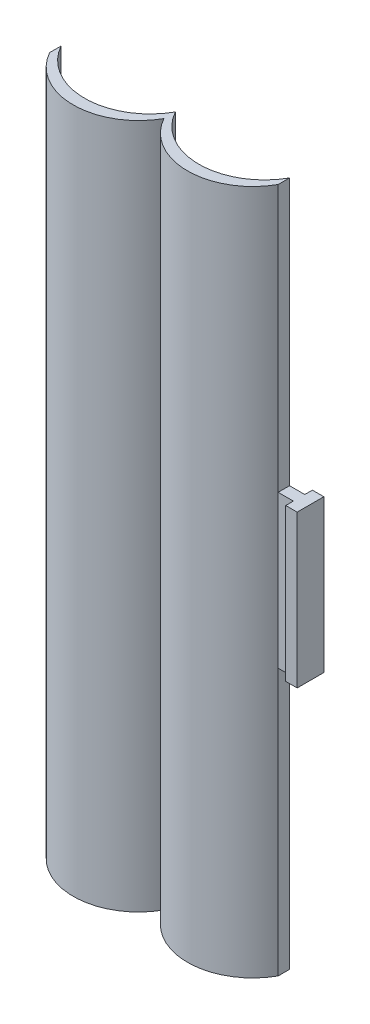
ISO-10303-21;
HEADER;
FILE_DESCRIPTION(('STEP AP214'),'2;1');
FILE_NAME('part.step','',(''),(''),'','','');
FILE_SCHEMA(('AUTOMOTIVE_DESIGN { 1 0 10303 214 1 1 1 1 }'));
ENDSEC;
DATA;
#1=APPLICATION_CONTEXT('core data for automotive mechanical design processes');
#2=APPLICATION_PROTOCOL_DEFINITION('international standard','automotive_design',2000,#1);
#3=PRODUCT_CONTEXT('',#1,'mechanical');
#4=PRODUCT('Part','Part','',(#3));
#5=PRODUCT_RELATED_PRODUCT_CATEGORY('part','',(#4));
#6=PRODUCT_DEFINITION_FORMATION('','',#4);
#7=PRODUCT_DEFINITION_CONTEXT('part definition',#1,'design');
#8=PRODUCT_DEFINITION('design','',#6,#7);
#9=PRODUCT_DEFINITION_SHAPE('','',#8);
#10=(LENGTH_UNIT() NAMED_UNIT(*) SI_UNIT(.MILLI.,.METRE.));
#11=(NAMED_UNIT(*) PLANE_ANGLE_UNIT() SI_UNIT($,.RADIAN.));
#12=(NAMED_UNIT(*) SI_UNIT($,.STERADIAN.) SOLID_ANGLE_UNIT());
#13=UNCERTAINTY_MEASURE_WITH_UNIT(LENGTH_MEASURE(1.E-05),#10,'distance_accuracy_value','');
#14=(GEOMETRIC_REPRESENTATION_CONTEXT(3) GLOBAL_UNCERTAINTY_ASSIGNED_CONTEXT((#13)) GLOBAL_UNIT_ASSIGNED_CONTEXT((#10,
#11,#12)) REPRESENTATION_CONTEXT('',''));
#15=CARTESIAN_POINT('',(0.,0.,0.));
#16=DIRECTION('',(0.,0.,1.));
#17=DIRECTION('',(1.,0.,0.));
#18=AXIS2_PLACEMENT_3D('',#15,#16,#17);
#19=CARTESIAN_POINT('',(0.,180.,0.));
#20=DIRECTION('',(-1.,0.,0.));
#21=DIRECTION('',(0.,0.,1.));
#22=AXIS2_PLACEMENT_3D('',#19,#20,#21);
#23=PLANE('',#22);
#24=DIRECTION('',(0.,0.,1.));
#25=VECTOR('',#24,1.);
#26=CARTESIAN_POINT('',(0.,110.,0.));
#27=LINE('',#26,#25);
#28=CARTESIAN_POINT('',(0.,110.,0.));
#29=VERTEX_POINT('',#28);
#30=CARTESIAN_POINT('',(0.,110.,3.));
#31=VERTEX_POINT('',#30);
#32=EDGE_CURVE('E137',#29,#31,#27,.T.);
#33=ORIENTED_EDGE('',*,*,#32,.F.);
#34=DIRECTION('',(0.,-1.,0.));
#35=VECTOR('',#34,1.);
#36=CARTESIAN_POINT('',(0.,180.,0.));
#37=LINE('',#36,#35);
#38=CARTESIAN_POINT('',(0.,180.,0.));
#39=VERTEX_POINT('',#38);
#40=EDGE_CURVE('E238',#39,#29,#37,.T.);
#41=ORIENTED_EDGE('',*,*,#40,.F.);
#42=DIRECTION('',(0.,0.,-1.));
#43=VECTOR('',#42,1.);
#44=CARTESIAN_POINT('',(0.,180.,0.));
#45=LINE('',#44,#43);
#46=CARTESIAN_POINT('',(0.,180.,3.));
#47=VERTEX_POINT('',#46);
#48=EDGE_CURVE('E139',#47,#39,#45,.T.);
#49=ORIENTED_EDGE('',*,*,#48,.F.);
#50=DIRECTION('',(0.,-1.,0.));
#51=VECTOR('',#50,1.);
#52=CARTESIAN_POINT('',(0.,180.,3.));
#53=LINE('',#52,#51);
#54=EDGE_CURVE('E133',#47,#31,#53,.T.);
#55=ORIENTED_EDGE('',*,*,#54,.T.);
#56=EDGE_LOOP('',(#33,#41,#49,#55));
#57=FACE_BOUND('',#56,.T.);
#58=ADVANCED_FACE('F33',(#57),#23,.F.);
#59=CARTESIAN_POINT('',(-15.,180.,-8.37302264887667));
#60=DIRECTION('',(0.,-1.,0.));
#61=DIRECTION('',(0.,0.,-1.));
#62=AXIS2_PLACEMENT_3D('',#59,#60,#61);
#63=CYLINDRICAL_SURFACE('',#62,17.1786934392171);
#64=CARTESIAN_POINT('',(-15.,0.,-8.37302264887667));
#65=DIRECTION('',(0.,-1.,0.));
#66=DIRECTION('',(0.,0.,-1.));
#67=AXIS2_PLACEMENT_3D('',#64,#65,#66);
#68=CIRCLE('',#67,17.1786934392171);
#69=CARTESIAN_POINT('',(0.,0.,0.));
#70=VERTEX_POINT('',#69);
#71=CARTESIAN_POINT('',(-30.,0.,0.));
#72=VERTEX_POINT('',#71);
#73=EDGE_CURVE('E152',#70,#72,#68,.T.);
#74=ORIENTED_EDGE('',*,*,#73,.T.);
#75=DIRECTION('',(0.,-1.,0.));
#76=VECTOR('',#75,1.);
#77=CARTESIAN_POINT('',(-30.,180.,0.));
#78=LINE('',#77,#76);
#79=CARTESIAN_POINT('',(-30.,180.,0.));
#80=VERTEX_POINT('',#79);
#81=EDGE_CURVE('E11',#80,#72,#78,.T.);
#82=ORIENTED_EDGE('',*,*,#81,.F.);
#83=CARTESIAN_POINT('',(-15.,180.,-8.37302264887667));
#84=DIRECTION('',(0.,-1.,0.));
#85=DIRECTION('',(0.,0.,-1.));
#86=AXIS2_PLACEMENT_3D('',#83,#84,#85);
#87=CIRCLE('',#86,17.1786934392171);
#88=EDGE_CURVE('E214',#39,#80,#87,.T.);
#89=ORIENTED_EDGE('',*,*,#88,.F.);
#90=ORIENTED_EDGE('',*,*,#40,.T.);
#91=DIRECTION('',(0.,-1.,0.));
#92=VECTOR('',#91,1.);
#93=CARTESIAN_POINT('',(0.,110.,0.));
#94=LINE('',#93,#92);
#95=CARTESIAN_POINT('',(0.,70.,0.));
#96=VERTEX_POINT('',#95);
#97=EDGE_CURVE('E184',#29,#96,#94,.T.);
#98=ORIENTED_EDGE('',*,*,#97,.T.);
#99=EDGE_CURVE('E53',#96,#70,#37,.T.);
#100=ORIENTED_EDGE('',*,*,#99,.T.);
#101=EDGE_LOOP('',(#74,#82,#89,#90,#98,#100));
#102=FACE_BOUND('',#101,.T.);
#103=ADVANCED_FACE('F35',(#102),#63,.F.);
#104=CARTESIAN_POINT('',(-45.,180.,-8.37302264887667));
#105=DIRECTION('',(0.,-1.,0.));
#106=DIRECTION('',(0.,0.,-1.));
#107=AXIS2_PLACEMENT_3D('',#104,#105,#106);
#108=CYLINDRICAL_SURFACE('',#107,17.1786934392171);
#109=CARTESIAN_POINT('',(-45.,0.,-8.37302264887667));
#110=DIRECTION('',(0.,-1.,0.));
#111=DIRECTION('',(0.,0.,1.));
#112=AXIS2_PLACEMENT_3D('',#109,#110,#111);
#113=CIRCLE('',#112,17.1786934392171);
#114=CARTESIAN_POINT('',(-60.,0.,0.));
#115=VERTEX_POINT('',#114);
#116=EDGE_CURVE('E229',#72,#115,#113,.T.);
#117=ORIENTED_EDGE('',*,*,#116,.T.);
#118=DIRECTION('',(0.,-1.,0.));
#119=VECTOR('',#118,1.);
#120=CARTESIAN_POINT('',(-60.,180.,0.));
#121=LINE('',#120,#119);
#122=CARTESIAN_POINT('',(-60.,180.,0.));
#123=VERTEX_POINT('',#122);
#124=EDGE_CURVE('E41',#123,#115,#121,.T.);
#125=ORIENTED_EDGE('',*,*,#124,.F.);
#126=CARTESIAN_POINT('',(-45.,180.,-8.37302264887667));
#127=DIRECTION('',(0.,-1.,0.));
#128=DIRECTION('',(0.,0.,1.));
#129=AXIS2_PLACEMENT_3D('',#126,#127,#128);
#130=CIRCLE('',#129,17.1786934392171);
#131=EDGE_CURVE('E217',#80,#123,#130,.T.);
#132=ORIENTED_EDGE('',*,*,#131,.F.);
#133=ORIENTED_EDGE('',*,*,#81,.T.);
#134=EDGE_LOOP('',(#117,#125,#132,#133));
#135=FACE_BOUND('',#134,.T.);
#136=ADVANCED_FACE('F266',(#135),#108,.F.);
#137=CARTESIAN_POINT('',(-60.,180.,0.));
#138=DIRECTION('',(1.,0.,0.));
#139=DIRECTION('',(0.,0.,-1.));
#140=AXIS2_PLACEMENT_3D('',#137,#138,#139);
#141=PLANE('',#140);
#142=DIRECTION('',(0.,0.,1.));
#143=VECTOR('',#142,1.);
#144=CARTESIAN_POINT('',(-60.,0.,0.));
#145=LINE('',#144,#143);
#146=CARTESIAN_POINT('',(-60.,0.,3.));
#147=VERTEX_POINT('',#146);
#148=EDGE_CURVE('E231',#115,#147,#145,.T.);
#149=ORIENTED_EDGE('',*,*,#148,.T.);
#150=DIRECTION('',(0.,-1.,0.));
#151=VECTOR('',#150,1.);
#152=CARTESIAN_POINT('',(-60.,180.,3.));
#153=LINE('',#152,#151);
#154=CARTESIAN_POINT('',(-60.,180.,3.));
#155=VERTEX_POINT('',#154);
#156=EDGE_CURVE('E242',#155,#147,#153,.T.);
#157=ORIENTED_EDGE('',*,*,#156,.F.);
#158=DIRECTION('',(0.,0.,1.));
#159=VECTOR('',#158,1.);
#160=CARTESIAN_POINT('',(-60.,180.,0.));
#161=LINE('',#160,#159);
#162=EDGE_CURVE('E220',#123,#155,#161,.T.);
#163=ORIENTED_EDGE('',*,*,#162,.F.);
#164=ORIENTED_EDGE('',*,*,#124,.T.);
#165=EDGE_LOOP('',(#149,#157,#163,#164));
#166=FACE_BOUND('',#165,.T.);
#167=ADVANCED_FACE('F249',(#166),#141,.F.);
#168=CARTESIAN_POINT('',(-45.,180.,-5.37302264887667));
#169=DIRECTION('',(0.,-1.,0.));
#170=DIRECTION('',(0.,0.,-1.));
#171=AXIS2_PLACEMENT_3D('',#168,#169,#170);
#172=CYLINDRICAL_SURFACE('',#171,17.1786934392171);
#173=CARTESIAN_POINT('',(-45.,0.,-5.37302264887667));
#174=DIRECTION('',(0.,1.,0.));
#175=DIRECTION('',(0.,0.,1.));
#176=AXIS2_PLACEMENT_3D('',#173,#174,#175);
#177=CIRCLE('',#176,17.1786934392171);
#178=CARTESIAN_POINT('',(-30.,0.,3.));
#179=VERTEX_POINT('',#178);
#180=EDGE_CURVE('E233',#147,#179,#177,.T.);
#181=ORIENTED_EDGE('',*,*,#180,.T.);
#182=DIRECTION('',(0.,-1.,0.));
#183=VECTOR('',#182,1.);
#184=CARTESIAN_POINT('',(-30.,180.,3.));
#185=LINE('',#184,#183);
#186=CARTESIAN_POINT('',(-30.,180.,3.));
#187=VERTEX_POINT('',#186);
#188=EDGE_CURVE('E142',#187,#179,#185,.T.);
#189=ORIENTED_EDGE('',*,*,#188,.F.);
#190=CARTESIAN_POINT('',(-45.,180.,-5.37302264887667));
#191=DIRECTION('',(0.,1.,0.));
#192=DIRECTION('',(0.,0.,1.));
#193=AXIS2_PLACEMENT_3D('',#190,#191,#192);
#194=CIRCLE('',#193,17.1786934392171);
#195=EDGE_CURVE('E222',#155,#187,#194,.T.);
#196=ORIENTED_EDGE('',*,*,#195,.F.);
#197=ORIENTED_EDGE('',*,*,#156,.T.);
#198=EDGE_LOOP('',(#181,#189,#196,#197));
#199=FACE_BOUND('',#198,.T.);
#200=ADVANCED_FACE('F260',(#199),#172,.T.);
#201=CARTESIAN_POINT('',(-15.,180.,-5.37302264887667));
#202=DIRECTION('',(0.,-1.,0.));
#203=DIRECTION('',(0.,0.,-1.));
#204=AXIS2_PLACEMENT_3D('',#201,#202,#203);
#205=CYLINDRICAL_SURFACE('',#204,17.1786934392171);
#206=CARTESIAN_POINT('',(-15.,0.,-5.37302264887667));
#207=DIRECTION('',(0.,1.,0.));
#208=DIRECTION('',(0.,0.,-1.));
#209=AXIS2_PLACEMENT_3D('',#206,#207,#208);
#210=CIRCLE('',#209,17.1786934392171);
#211=CARTESIAN_POINT('',(0.,0.,3.));
#212=VERTEX_POINT('',#211);
#213=EDGE_CURVE('E235',#179,#212,#210,.T.);
#214=ORIENTED_EDGE('',*,*,#213,.T.);
#215=CARTESIAN_POINT('',(0.,70.,3.));
#216=VERTEX_POINT('',#215);
#217=EDGE_CURVE('E143',#216,#212,#53,.T.);
#218=ORIENTED_EDGE('',*,*,#217,.F.);
#219=DIRECTION('',(0.,-1.,0.));
#220=VECTOR('',#219,1.);
#221=CARTESIAN_POINT('',(0.,110.,3.));
#222=LINE('',#221,#220);
#223=EDGE_CURVE('E146',#31,#216,#222,.T.);
#224=ORIENTED_EDGE('',*,*,#223,.F.);
#225=ORIENTED_EDGE('',*,*,#54,.F.);
#226=CARTESIAN_POINT('',(-15.,180.,-5.37302264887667));
#227=DIRECTION('',(0.,1.,0.));
#228=DIRECTION('',(0.,0.,-1.));
#229=AXIS2_PLACEMENT_3D('',#226,#227,#228);
#230=CIRCLE('',#229,17.1786934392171);
#231=EDGE_CURVE('E224',#187,#47,#230,.T.);
#232=ORIENTED_EDGE('',*,*,#231,.F.);
#233=ORIENTED_EDGE('',*,*,#188,.T.);
#234=EDGE_LOOP('',(#214,#218,#224,#225,#232,#233));
#235=FACE_BOUND('',#234,.T.);
#236=ADVANCED_FACE('F149',(#235),#205,.T.);
#237=ORIENTED_EDGE('',*,*,#99,.F.);
#238=DIRECTION('',(0.,0.,1.));
#239=VECTOR('',#238,1.);
#240=CARTESIAN_POINT('',(0.,70.,0.));
#241=LINE('',#240,#239);
#242=EDGE_CURVE('E48',#96,#216,#241,.T.);
#243=ORIENTED_EDGE('',*,*,#242,.T.);
#244=ORIENTED_EDGE('',*,*,#217,.T.);
#245=DIRECTION('',(0.,0.,-1.));
#246=VECTOR('',#245,1.);
#247=CARTESIAN_POINT('',(0.,0.,0.));
#248=LINE('',#247,#246);
#249=EDGE_CURVE('E218',#212,#70,#248,.T.);
#250=ORIENTED_EDGE('',*,*,#249,.T.);
#251=EDGE_LOOP('',(#237,#243,#244,#250));
#252=FACE_BOUND('',#251,.T.);
#253=ADVANCED_FACE('F268',(#252),#23,.F.);
#254=CARTESIAN_POINT('',(-15.,180.,-8.37302264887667));
#255=DIRECTION('',(0.,-1.,0.));
#256=DIRECTION('',(0.,0.,-1.));
#257=AXIS2_PLACEMENT_3D('',#254,#255,#256);
#258=PLANE('',#257);
#259=ORIENTED_EDGE('',*,*,#88,.T.);
#260=ORIENTED_EDGE('',*,*,#131,.T.);
#261=ORIENTED_EDGE('',*,*,#162,.T.);
#262=ORIENTED_EDGE('',*,*,#195,.T.);
#263=ORIENTED_EDGE('',*,*,#231,.T.);
#264=ORIENTED_EDGE('',*,*,#48,.T.);
#265=EDGE_LOOP('',(#259,#260,#261,#262,#263,#264));
#266=FACE_BOUND('',#265,.T.);
#267=ADVANCED_FACE('F263',(#266),#258,.F.);
#268=CARTESIAN_POINT('',(-15.,0.,-8.37302264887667));
#269=DIRECTION('',(0.,-1.,0.));
#270=DIRECTION('',(0.,0.,-1.));
#271=AXIS2_PLACEMENT_3D('',#268,#269,#270);
#272=PLANE('',#271);
#273=ORIENTED_EDGE('',*,*,#73,.F.);
#274=ORIENTED_EDGE('',*,*,#249,.F.);
#275=ORIENTED_EDGE('',*,*,#213,.F.);
#276=ORIENTED_EDGE('',*,*,#180,.F.);
#277=ORIENTED_EDGE('',*,*,#148,.F.);
#278=ORIENTED_EDGE('',*,*,#116,.F.);
#279=EDGE_LOOP('',(#273,#274,#275,#276,#277,#278));
#280=FACE_BOUND('',#279,.T.);
#281=ADVANCED_FACE('F255',(#280),#272,.T.);
#282=CARTESIAN_POINT('',(0.,110.,3.));
#283=DIRECTION('',(0.,0.,-1.));
#284=DIRECTION('',(-1.,0.,0.));
#285=AXIS2_PLACEMENT_3D('',#282,#283,#284);
#286=PLANE('',#285);
#287=DIRECTION('',(1.,0.,0.));
#288=VECTOR('',#287,1.);
#289=CARTESIAN_POINT('',(0.,70.,3.));
#290=LINE('',#289,#288);
#291=CARTESIAN_POINT('',(4.,70.,3.));
#292=VERTEX_POINT('',#291);
#293=EDGE_CURVE('E186',#216,#292,#290,.T.);
#294=ORIENTED_EDGE('',*,*,#293,.T.);
#295=DIRECTION('',(0.,-1.,0.));
#296=VECTOR('',#295,1.);
#297=CARTESIAN_POINT('',(4.,110.,3.));
#298=LINE('',#297,#296);
#299=CARTESIAN_POINT('',(4.,110.,3.));
#300=VERTEX_POINT('',#299);
#301=EDGE_CURVE('E153',#300,#292,#298,.T.);
#302=ORIENTED_EDGE('',*,*,#301,.F.);
#303=DIRECTION('',(1.,0.,0.));
#304=VECTOR('',#303,1.);
#305=CARTESIAN_POINT('',(0.,110.,3.));
#306=LINE('',#305,#304);
#307=EDGE_CURVE('E156',#31,#300,#306,.T.);
#308=ORIENTED_EDGE('',*,*,#307,.F.);
#309=ORIENTED_EDGE('',*,*,#223,.T.);
#310=EDGE_LOOP('',(#294,#302,#308,#309));
#311=FACE_BOUND('',#310,.T.);
#312=ADVANCED_FACE('F157',(#311),#286,.F.);
#313=CARTESIAN_POINT('',(4.,110.,3.));
#314=DIRECTION('',(1.,0.,0.));
#315=DIRECTION('',(0.,0.,-1.));
#316=AXIS2_PLACEMENT_3D('',#313,#314,#315);
#317=PLANE('',#316);
#318=DIRECTION('',(0.,0.,1.));
#319=VECTOR('',#318,1.);
#320=CARTESIAN_POINT('',(4.,70.,3.));
#321=LINE('',#320,#319);
#322=CARTESIAN_POINT('',(4.,70.,5.));
#323=VERTEX_POINT('',#322);
#324=EDGE_CURVE('E188',#292,#323,#321,.T.);
#325=ORIENTED_EDGE('',*,*,#324,.T.);
#326=DIRECTION('',(0.,-1.,0.));
#327=VECTOR('',#326,1.);
#328=CARTESIAN_POINT('',(4.,110.,5.));
#329=LINE('',#328,#327);
#330=CARTESIAN_POINT('',(4.,110.,5.));
#331=VERTEX_POINT('',#330);
#332=EDGE_CURVE('E210',#331,#323,#329,.T.);
#333=ORIENTED_EDGE('',*,*,#332,.F.);
#334=DIRECTION('',(0.,0.,1.));
#335=VECTOR('',#334,1.);
#336=CARTESIAN_POINT('',(4.,110.,3.));
#337=LINE('',#336,#335);
#338=EDGE_CURVE('E161',#300,#331,#337,.T.);
#339=ORIENTED_EDGE('',*,*,#338,.F.);
#340=ORIENTED_EDGE('',*,*,#301,.T.);
#341=EDGE_LOOP('',(#325,#333,#339,#340));
#342=FACE_BOUND('',#341,.T.);
#343=ADVANCED_FACE('F316',(#342),#317,.F.);
#344=CARTESIAN_POINT('',(4.,110.,5.));
#345=DIRECTION('',(0.,0.,-1.));
#346=DIRECTION('',(-1.,0.,0.));
#347=AXIS2_PLACEMENT_3D('',#344,#345,#346);
#348=PLANE('',#347);
#349=DIRECTION('',(1.,0.,0.));
#350=VECTOR('',#349,1.);
#351=CARTESIAN_POINT('',(4.,70.,5.));
#352=LINE('',#351,#350);
#353=CARTESIAN_POINT('',(7.,70.,5.));
#354=VERTEX_POINT('',#353);
#355=EDGE_CURVE('E190',#323,#354,#352,.T.);
#356=ORIENTED_EDGE('',*,*,#355,.T.);
#357=DIRECTION('',(0.,-1.,0.));
#358=VECTOR('',#357,1.);
#359=CARTESIAN_POINT('',(7.,110.,5.));
#360=LINE('',#359,#358);
#361=CARTESIAN_POINT('',(7.,110.,5.));
#362=VERTEX_POINT('',#361);
#363=EDGE_CURVE('E207',#362,#354,#360,.T.);
#364=ORIENTED_EDGE('',*,*,#363,.F.);
#365=DIRECTION('',(1.,0.,0.));
#366=VECTOR('',#365,1.);
#367=CARTESIAN_POINT('',(4.,110.,5.));
#368=LINE('',#367,#366);
#369=EDGE_CURVE('E175',#331,#362,#368,.T.);
#370=ORIENTED_EDGE('',*,*,#369,.F.);
#371=ORIENTED_EDGE('',*,*,#332,.T.);
#372=EDGE_LOOP('',(#356,#364,#370,#371));
#373=FACE_BOUND('',#372,.T.);
#374=ADVANCED_FACE('F327',(#373),#348,.F.);
#375=CARTESIAN_POINT('',(7.,110.,-2.));
#376=DIRECTION('',(-1.,0.,0.));
#377=DIRECTION('',(0.,0.,1.));
#378=AXIS2_PLACEMENT_3D('',#375,#376,#377);
#379=PLANE('',#378);
#380=DIRECTION('',(0.,0.,-1.));
#381=VECTOR('',#380,1.);
#382=CARTESIAN_POINT('',(7.,70.,-2.));
#383=LINE('',#382,#381);
#384=CARTESIAN_POINT('',(7.,70.,-2.));
#385=VERTEX_POINT('',#384);
#386=EDGE_CURVE('E192',#354,#385,#383,.T.);
#387=ORIENTED_EDGE('',*,*,#386,.T.);
#388=DIRECTION('',(0.,-1.,0.));
#389=VECTOR('',#388,1.);
#390=CARTESIAN_POINT('',(7.,110.,-2.));
#391=LINE('',#390,#389);
#392=CARTESIAN_POINT('',(7.,110.,-2.));
#393=VERTEX_POINT('',#392);
#394=EDGE_CURVE('E204',#393,#385,#391,.T.);
#395=ORIENTED_EDGE('',*,*,#394,.F.);
#396=DIRECTION('',(0.,0.,-1.));
#397=VECTOR('',#396,1.);
#398=CARTESIAN_POINT('',(7.,110.,-2.));
#399=LINE('',#398,#397);
#400=EDGE_CURVE('E177',#362,#393,#399,.T.);
#401=ORIENTED_EDGE('',*,*,#400,.F.);
#402=ORIENTED_EDGE('',*,*,#363,.T.);
#403=EDGE_LOOP('',(#387,#395,#401,#402));
#404=FACE_BOUND('',#403,.T.);
#405=ADVANCED_FACE('F337',(#404),#379,.F.);
#406=CARTESIAN_POINT('',(4.,110.,-2.));
#407=DIRECTION('',(0.,0.,1.));
#408=DIRECTION('',(1.,0.,0.));
#409=AXIS2_PLACEMENT_3D('',#406,#407,#408);
#410=PLANE('',#409);
#411=DIRECTION('',(-1.,0.,0.));
#412=VECTOR('',#411,1.);
#413=CARTESIAN_POINT('',(4.,70.,-2.));
#414=LINE('',#413,#412);
#415=CARTESIAN_POINT('',(4.,70.,-2.));
#416=VERTEX_POINT('',#415);
#417=EDGE_CURVE('E194',#385,#416,#414,.T.);
#418=ORIENTED_EDGE('',*,*,#417,.T.);
#419=DIRECTION('',(0.,-1.,0.));
#420=VECTOR('',#419,1.);
#421=CARTESIAN_POINT('',(4.,110.,-2.));
#422=LINE('',#421,#420);
#423=CARTESIAN_POINT('',(4.,110.,-2.));
#424=VERTEX_POINT('',#423);
#425=EDGE_CURVE('E201',#424,#416,#422,.T.);
#426=ORIENTED_EDGE('',*,*,#425,.F.);
#427=DIRECTION('',(-1.,0.,0.));
#428=VECTOR('',#427,1.);
#429=CARTESIAN_POINT('',(4.,110.,-2.));
#430=LINE('',#429,#428);
#431=EDGE_CURVE('E179',#393,#424,#430,.T.);
#432=ORIENTED_EDGE('',*,*,#431,.F.);
#433=ORIENTED_EDGE('',*,*,#394,.T.);
#434=EDGE_LOOP('',(#418,#426,#432,#433));
#435=FACE_BOUND('',#434,.T.);
#436=ADVANCED_FACE('F347',(#435),#410,.F.);
#437=CARTESIAN_POINT('',(4.,110.,-2.));
#438=DIRECTION('',(1.,0.,0.));
#439=DIRECTION('',(0.,0.,-1.));
#440=AXIS2_PLACEMENT_3D('',#437,#438,#439);
#441=PLANE('',#440);
#442=DIRECTION('',(0.,0.,1.));
#443=VECTOR('',#442,1.);
#444=CARTESIAN_POINT('',(4.,70.,-2.));
#445=LINE('',#444,#443);
#446=CARTESIAN_POINT('',(4.,70.,0.));
#447=VERTEX_POINT('',#446);
#448=EDGE_CURVE('E171',#416,#447,#445,.T.);
#449=ORIENTED_EDGE('',*,*,#448,.T.);
#450=DIRECTION('',(0.,-1.,0.));
#451=VECTOR('',#450,1.);
#452=CARTESIAN_POINT('',(4.,110.,0.));
#453=LINE('',#452,#451);
#454=CARTESIAN_POINT('',(4.,110.,0.));
#455=VERTEX_POINT('',#454);
#456=EDGE_CURVE('E198',#455,#447,#453,.T.);
#457=ORIENTED_EDGE('',*,*,#456,.F.);
#458=DIRECTION('',(0.,0.,1.));
#459=VECTOR('',#458,1.);
#460=CARTESIAN_POINT('',(4.,110.,-2.));
#461=LINE('',#460,#459);
#462=EDGE_CURVE('E181',#424,#455,#461,.T.);
#463=ORIENTED_EDGE('',*,*,#462,.F.);
#464=ORIENTED_EDGE('',*,*,#425,.T.);
#465=EDGE_LOOP('',(#449,#457,#463,#464));
#466=FACE_BOUND('',#465,.T.);
#467=ADVANCED_FACE('F357',(#466),#441,.F.);
#468=CARTESIAN_POINT('',(0.,110.,0.));
#469=DIRECTION('',(0.,0.,1.));
#470=DIRECTION('',(1.,0.,0.));
#471=AXIS2_PLACEMENT_3D('',#468,#469,#470);
#472=PLANE('',#471);
#473=DIRECTION('',(-1.,0.,0.));
#474=VECTOR('',#473,1.);
#475=CARTESIAN_POINT('',(0.,70.,0.));
#476=LINE('',#475,#474);
#477=EDGE_CURVE('E168',#447,#96,#476,.T.);
#478=ORIENTED_EDGE('',*,*,#477,.T.);
#479=ORIENTED_EDGE('',*,*,#97,.F.);
#480=DIRECTION('',(-1.,0.,0.));
#481=VECTOR('',#480,1.);
#482=CARTESIAN_POINT('',(0.,110.,0.));
#483=LINE('',#482,#481);
#484=EDGE_CURVE('E166',#455,#29,#483,.T.);
#485=ORIENTED_EDGE('',*,*,#484,.F.);
#486=ORIENTED_EDGE('',*,*,#456,.T.);
#487=EDGE_LOOP('',(#478,#479,#485,#486));
#488=FACE_BOUND('',#487,.T.);
#489=ADVANCED_FACE('F367',(#488),#472,.F.);
#490=CARTESIAN_POINT('',(0.,110.,0.));
#491=DIRECTION('',(0.,1.,0.));
#492=DIRECTION('',(0.,0.,1.));
#493=AXIS2_PLACEMENT_3D('',#490,#491,#492);
#494=PLANE('',#493);
#495=ORIENTED_EDGE('',*,*,#32,.T.);
#496=ORIENTED_EDGE('',*,*,#307,.T.);
#497=ORIENTED_EDGE('',*,*,#338,.T.);
#498=ORIENTED_EDGE('',*,*,#369,.T.);
#499=ORIENTED_EDGE('',*,*,#400,.T.);
#500=ORIENTED_EDGE('',*,*,#431,.T.);
#501=ORIENTED_EDGE('',*,*,#462,.T.);
#502=ORIENTED_EDGE('',*,*,#484,.T.);
#503=EDGE_LOOP('',(#495,#496,#497,#498,#499,#500,#501,#502));
#504=FACE_BOUND('',#503,.T.);
#505=ADVANCED_FACE('F164',(#504),#494,.T.);
#506=CARTESIAN_POINT('',(0.,70.,0.));
#507=DIRECTION('',(0.,1.,0.));
#508=DIRECTION('',(0.,0.,1.));
#509=AXIS2_PLACEMENT_3D('',#506,#507,#508);
#510=PLANE('',#509);
#511=ORIENTED_EDGE('',*,*,#242,.F.);
#512=ORIENTED_EDGE('',*,*,#477,.F.);
#513=ORIENTED_EDGE('',*,*,#448,.F.);
#514=ORIENTED_EDGE('',*,*,#417,.F.);
#515=ORIENTED_EDGE('',*,*,#386,.F.);
#516=ORIENTED_EDGE('',*,*,#355,.F.);
#517=ORIENTED_EDGE('',*,*,#324,.F.);
#518=ORIENTED_EDGE('',*,*,#293,.F.);
#519=EDGE_LOOP('',(#511,#512,#513,#514,#515,#516,#517,#518));
#520=FACE_BOUND('',#519,.T.);
#521=ADVANCED_FACE('F386',(#520),#510,.F.);
#522=CLOSED_SHELL('',(#58,#103,#136,#167,#200,#236,#253,#267,#281,#312,#343,#374,#405,#436,#467,
#489,#505,#521));
#523=MANIFOLD_SOLID_BREP('B2',#522);
#524=ADVANCED_BREP_SHAPE_REPRESENTATION('',(#18,#523),#14);
#525=SHAPE_DEFINITION_REPRESENTATION(#9,#524);
ENDSEC;
END-ISO-10303-21;
